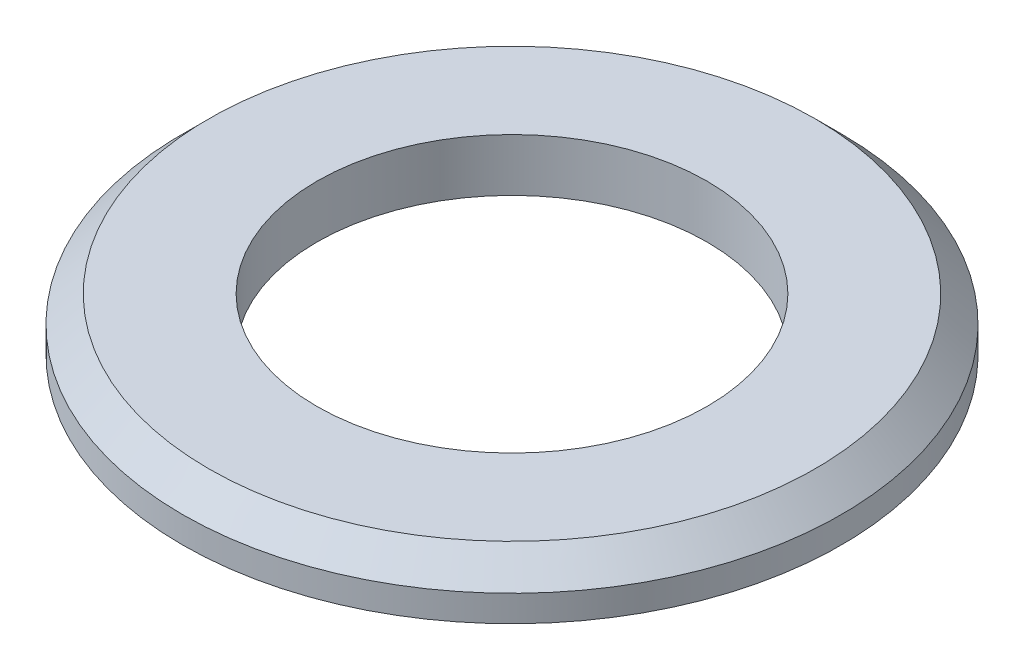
from build123d import *

# Parameters (mm, degrees)
SKETCH1_R      = 62.5
SKETCH1_R_2    = 37
EXTRUDE1_DEPTH = 10
CHAMFER1_SIZE  = 5


with BuildPart() as part:
    # Sketch1 → Extrude1 (new body)
    with BuildSketch(Plane(origin=(0, 0, 0), x_dir=(1, 0, 0), z_dir=(0, 1, 0))):
        with Locations(Location((0, 0, 0), (0, 0, 270))):
            Circle(SKETCH1_R)
        with Locations(Location((0, 0, 0), (0, 0, 270))):
            Circle(SKETCH1_R_2, mode=Mode.SUBTRACT)
    extrude(amount=EXTRUDE1_DEPTH)

    # Chamfer1
    chamfer1_edges = [part.edges().sort_by_distance(p)[0] for p in [
        (0, 10, -62.5),
    ]]
    chamfer(chamfer1_edges, length=CHAMFER1_SIZE)


solid = part.part
